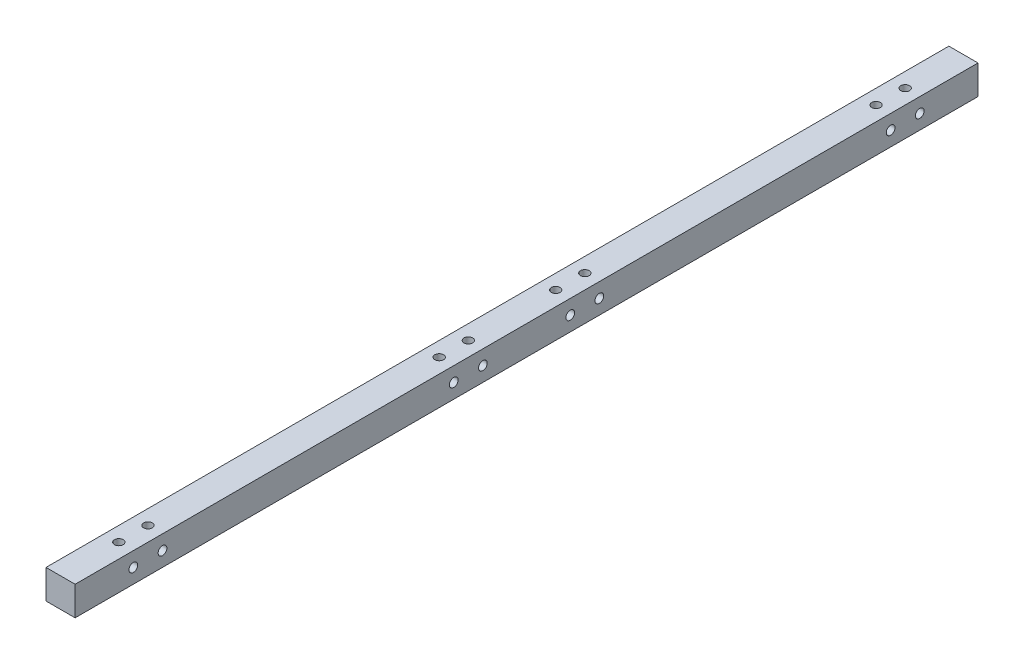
ISO-10303-21;
HEADER;
FILE_DESCRIPTION(('STEP AP214'),'2;1');
FILE_NAME('part.step','',(''),(''),'','','');
FILE_SCHEMA(('AUTOMOTIVE_DESIGN { 1 0 10303 214 1 1 1 1 }'));
ENDSEC;
DATA;
#1=APPLICATION_CONTEXT('core data for automotive mechanical design processes');
#2=APPLICATION_PROTOCOL_DEFINITION('international standard','automotive_design',2000,#1);
#3=PRODUCT_CONTEXT('',#1,'mechanical');
#4=PRODUCT('Part','Part','',(#3));
#5=PRODUCT_RELATED_PRODUCT_CATEGORY('part','',(#4));
#6=PRODUCT_DEFINITION_FORMATION('','',#4);
#7=PRODUCT_DEFINITION_CONTEXT('part definition',#1,'design');
#8=PRODUCT_DEFINITION('design','',#6,#7);
#9=PRODUCT_DEFINITION_SHAPE('','',#8);
#10=(LENGTH_UNIT() NAMED_UNIT(*) SI_UNIT(.MILLI.,.METRE.));
#11=(NAMED_UNIT(*) PLANE_ANGLE_UNIT() SI_UNIT($,.RADIAN.));
#12=(NAMED_UNIT(*) SI_UNIT($,.STERADIAN.) SOLID_ANGLE_UNIT());
#13=UNCERTAINTY_MEASURE_WITH_UNIT(LENGTH_MEASURE(1.E-05),#10,'distance_accuracy_value','');
#14=(GEOMETRIC_REPRESENTATION_CONTEXT(3) GLOBAL_UNCERTAINTY_ASSIGNED_CONTEXT((#13)) GLOBAL_UNIT_ASSIGNED_CONTEXT((#10,
#11,#12)) REPRESENTATION_CONTEXT('',''));
#15=CARTESIAN_POINT('',(0.,0.,0.));
#16=DIRECTION('',(0.,0.,1.));
#17=DIRECTION('',(1.,0.,0.));
#18=AXIS2_PLACEMENT_3D('',#15,#16,#17);
#19=CARTESIAN_POINT('',(0.,5.00000000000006,290.));
#20=DIRECTION('',(1.,0.,0.));
#21=DIRECTION('',(0.,0.,-1.));
#22=AXIS2_PLACEMENT_3D('',#19,#20,#21);
#23=CYLINDRICAL_SURFACE('',#22,1.50000000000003);
#24=CARTESIAN_POINT('',(10.,5.00000000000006,290.));
#25=DIRECTION('',(1.,0.,0.));
#26=DIRECTION('',(0.,0.,1.));
#27=AXIS2_PLACEMENT_3D('',#24,#25,#26);
#28=CIRCLE('',#27,1.50000000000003);
#29=CARTESIAN_POINT('',(10.,5.00000000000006,291.5));
#30=VERTEX_POINT('',#29);
#31=EDGE_CURVE('E253',#30,#30,#28,.T.);
#32=ORIENTED_EDGE('',*,*,#31,.T.);
#33=EDGE_LOOP('',(#32));
#34=FACE_BOUND('',#33,.T.);
#35=CARTESIAN_POINT('',(5.0000000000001,5.00000000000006,290.));
#36=DIRECTION('',(0.707106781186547,-0.707106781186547,0.));
#37=DIRECTION('',(0.707106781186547,0.707106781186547,0.));
#38=AXIS2_PLACEMENT_3D('',#35,#36,#37);
#39=ELLIPSE('',#38,2.12132034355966,1.50000000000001);
#40=CARTESIAN_POINT('',(5.0000000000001,5.00000000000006,291.5));
#41=VERTEX_POINT('',#40);
#42=CARTESIAN_POINT('',(5.0000000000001,5.00000000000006,288.5));
#43=VERTEX_POINT('',#42);
#44=EDGE_CURVE('E39',#41,#43,#39,.F.);
#45=ORIENTED_EDGE('',*,*,#44,.T.);
#46=CARTESIAN_POINT('',(5.0000000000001,5.00000000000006,290.));
#47=DIRECTION('',(0.707106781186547,0.707106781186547,0.));
#48=DIRECTION('',(0.707106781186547,-0.707106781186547,0.));
#49=AXIS2_PLACEMENT_3D('',#46,#47,#48);
#50=ELLIPSE('',#49,2.12132034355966,1.50000000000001);
#51=EDGE_CURVE('E11',#43,#41,#50,.F.);
#52=ORIENTED_EDGE('',*,*,#51,.T.);
#53=EDGE_LOOP('',(#45,#52));
#54=FACE_BOUND('',#53,.T.);
#55=ADVANCED_FACE('F26',(#34,#54),#23,.F.);
#56=CARTESIAN_POINT('',(0.,5.00000000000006,280.));
#57=DIRECTION('',(1.,0.,0.));
#58=DIRECTION('',(0.,0.,-1.));
#59=AXIS2_PLACEMENT_3D('',#56,#57,#58);
#60=CYLINDRICAL_SURFACE('',#59,1.50000000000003);
#61=CARTESIAN_POINT('',(10.,5.00000000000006,280.));
#62=DIRECTION('',(1.,0.,0.));
#63=DIRECTION('',(0.,0.,1.));
#64=AXIS2_PLACEMENT_3D('',#61,#62,#63);
#65=CIRCLE('',#64,1.50000000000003);
#66=CARTESIAN_POINT('',(10.,5.00000000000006,281.5));
#67=VERTEX_POINT('',#66);
#68=EDGE_CURVE('E247',#67,#67,#65,.T.);
#69=ORIENTED_EDGE('',*,*,#68,.T.);
#70=EDGE_LOOP('',(#69));
#71=FACE_BOUND('',#70,.T.);
#72=CARTESIAN_POINT('',(5.0000000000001,5.00000000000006,280.));
#73=DIRECTION('',(0.707106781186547,-0.707106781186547,0.));
#74=DIRECTION('',(0.707106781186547,0.707106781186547,0.));
#75=AXIS2_PLACEMENT_3D('',#72,#73,#74);
#76=ELLIPSE('',#75,2.12132034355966,1.50000000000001);
#77=CARTESIAN_POINT('',(5.0000000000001,5.00000000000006,281.5));
#78=VERTEX_POINT('',#77);
#79=CARTESIAN_POINT('',(5.0000000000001,5.00000000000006,278.5));
#80=VERTEX_POINT('',#79);
#81=EDGE_CURVE('E46',#78,#80,#76,.F.);
#82=ORIENTED_EDGE('',*,*,#81,.T.);
#83=CARTESIAN_POINT('',(5.0000000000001,5.00000000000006,280.));
#84=DIRECTION('',(0.707106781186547,0.707106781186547,0.));
#85=DIRECTION('',(0.707106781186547,-0.707106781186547,0.));
#86=AXIS2_PLACEMENT_3D('',#83,#84,#85);
#87=ELLIPSE('',#86,2.12132034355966,1.50000000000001);
#88=EDGE_CURVE('E123',#80,#78,#87,.F.);
#89=ORIENTED_EDGE('',*,*,#88,.T.);
#90=EDGE_LOOP('',(#82,#89));
#91=FACE_BOUND('',#90,.T.);
#92=ADVANCED_FACE('F378',(#71,#91),#60,.F.);
#93=CARTESIAN_POINT('',(0.,5.,180.));
#94=DIRECTION('',(1.,0.,0.));
#95=DIRECTION('',(0.,0.,-1.));
#96=AXIS2_PLACEMENT_3D('',#93,#94,#95);
#97=CYLINDRICAL_SURFACE('',#96,1.50000000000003);
#98=CARTESIAN_POINT('',(10.,5.,180.));
#99=DIRECTION('',(1.,0.,0.));
#100=DIRECTION('',(0.,0.,-1.));
#101=AXIS2_PLACEMENT_3D('',#98,#99,#100);
#102=CIRCLE('',#101,1.50000000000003);
#103=CARTESIAN_POINT('',(10.,5.,178.5));
#104=VERTEX_POINT('',#103);
#105=EDGE_CURVE('E241',#104,#104,#102,.T.);
#106=ORIENTED_EDGE('',*,*,#105,.T.);
#107=EDGE_LOOP('',(#106));
#108=FACE_BOUND('',#107,.T.);
#109=CARTESIAN_POINT('',(5.,5.,180.));
#110=DIRECTION('',(0.707106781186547,-0.707106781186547,0.));
#111=DIRECTION('',(0.707106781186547,0.707106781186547,0.));
#112=AXIS2_PLACEMENT_3D('',#109,#110,#111);
#113=ELLIPSE('',#112,2.12132034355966,1.50000000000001);
#114=CARTESIAN_POINT('',(5.,5.,181.5));
#115=VERTEX_POINT('',#114);
#116=CARTESIAN_POINT('',(5.,5.,178.5));
#117=VERTEX_POINT('',#116);
#118=EDGE_CURVE('E145',#115,#117,#113,.F.);
#119=ORIENTED_EDGE('',*,*,#118,.T.);
#120=CARTESIAN_POINT('',(5.,5.,180.));
#121=DIRECTION('',(0.707106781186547,0.707106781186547,0.));
#122=DIRECTION('',(0.707106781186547,-0.707106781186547,0.));
#123=AXIS2_PLACEMENT_3D('',#120,#121,#122);
#124=ELLIPSE('',#123,2.12132034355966,1.50000000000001);
#125=EDGE_CURVE('E136',#117,#115,#124,.F.);
#126=ORIENTED_EDGE('',*,*,#125,.T.);
#127=EDGE_LOOP('',(#119,#126));
#128=FACE_BOUND('',#127,.T.);
#129=ADVANCED_FACE('F384',(#108,#128),#97,.F.);
#130=CARTESIAN_POINT('',(0.,5.,170.));
#131=DIRECTION('',(1.,0.,0.));
#132=DIRECTION('',(0.,0.,-1.));
#133=AXIS2_PLACEMENT_3D('',#130,#131,#132);
#134=CYLINDRICAL_SURFACE('',#133,1.50000000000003);
#135=CARTESIAN_POINT('',(10.,5.,170.));
#136=DIRECTION('',(1.,0.,0.));
#137=DIRECTION('',(0.,0.,-1.));
#138=AXIS2_PLACEMENT_3D('',#135,#136,#137);
#139=CIRCLE('',#138,1.50000000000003);
#140=CARTESIAN_POINT('',(10.,5.,168.5));
#141=VERTEX_POINT('',#140);
#142=EDGE_CURVE('E235',#141,#141,#139,.T.);
#143=ORIENTED_EDGE('',*,*,#142,.T.);
#144=EDGE_LOOP('',(#143));
#145=FACE_BOUND('',#144,.T.);
#146=CARTESIAN_POINT('',(4.99999999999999,5.,170.));
#147=DIRECTION('',(0.707106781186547,-0.707106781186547,0.));
#148=DIRECTION('',(0.707106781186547,0.707106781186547,0.));
#149=AXIS2_PLACEMENT_3D('',#146,#147,#148);
#150=ELLIPSE('',#149,2.12132034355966,1.50000000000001);
#151=CARTESIAN_POINT('',(4.99999999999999,5.,171.5));
#152=VERTEX_POINT('',#151);
#153=CARTESIAN_POINT('',(4.99999999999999,5.,168.5));
#154=VERTEX_POINT('',#153);
#155=EDGE_CURVE('E156',#152,#154,#150,.F.);
#156=ORIENTED_EDGE('',*,*,#155,.T.);
#157=CARTESIAN_POINT('',(4.99999999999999,5.,170.));
#158=DIRECTION('',(0.707106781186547,0.707106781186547,0.));
#159=DIRECTION('',(0.707106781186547,-0.707106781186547,0.));
#160=AXIS2_PLACEMENT_3D('',#157,#158,#159);
#161=ELLIPSE('',#160,2.12132034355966,1.50000000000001);
#162=EDGE_CURVE('E147',#154,#152,#161,.F.);
#163=ORIENTED_EDGE('',*,*,#162,.T.);
#164=EDGE_LOOP('',(#156,#163));
#165=FACE_BOUND('',#164,.T.);
#166=ADVANCED_FACE('F411',(#145,#165),#134,.F.);
#167=CARTESIAN_POINT('',(0.,5.00000000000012,30.));
#168=DIRECTION('',(1.,0.,0.));
#169=DIRECTION('',(0.,0.,-1.));
#170=AXIS2_PLACEMENT_3D('',#167,#168,#169);
#171=CYLINDRICAL_SURFACE('',#170,1.5);
#172=CARTESIAN_POINT('',(10.,5.00000000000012,30.));
#173=DIRECTION('',(1.,0.,0.));
#174=DIRECTION('',(0.,0.,-1.));
#175=AXIS2_PLACEMENT_3D('',#172,#173,#174);
#176=CIRCLE('',#175,1.5);
#177=CARTESIAN_POINT('',(10.,5.00000000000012,28.5));
#178=VERTEX_POINT('',#177);
#179=EDGE_CURVE('E265',#178,#178,#176,.T.);
#180=ORIENTED_EDGE('',*,*,#179,.T.);
#181=EDGE_LOOP('',(#180));
#182=FACE_BOUND('',#181,.T.);
#183=CARTESIAN_POINT('',(5.,5.00000000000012,30.));
#184=DIRECTION('',(0.707106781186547,-0.707106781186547,0.));
#185=DIRECTION('',(0.707106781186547,0.707106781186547,0.));
#186=AXIS2_PLACEMENT_3D('',#183,#184,#185);
#187=ELLIPSE('',#186,2.12132034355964,1.5);
#188=CARTESIAN_POINT('',(5.,5.00000000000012,31.5));
#189=VERTEX_POINT('',#188);
#190=CARTESIAN_POINT('',(5.,5.00000000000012,28.5));
#191=VERTEX_POINT('',#190);
#192=EDGE_CURVE('E167',#189,#191,#187,.F.);
#193=ORIENTED_EDGE('',*,*,#192,.T.);
#194=CARTESIAN_POINT('',(5.,5.00000000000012,30.));
#195=DIRECTION('',(0.707106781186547,0.707106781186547,0.));
#196=DIRECTION('',(0.707106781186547,-0.707106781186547,0.));
#197=AXIS2_PLACEMENT_3D('',#194,#195,#196);
#198=ELLIPSE('',#197,2.12132034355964,1.5);
#199=EDGE_CURVE('E158',#191,#189,#198,.F.);
#200=ORIENTED_EDGE('',*,*,#199,.T.);
#201=EDGE_LOOP('',(#193,#200));
#202=FACE_BOUND('',#201,.T.);
#203=ADVANCED_FACE('F464',(#182,#202),#171,.F.);
#204=CARTESIAN_POINT('',(0.,5.00000000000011,20.));
#205=DIRECTION('',(1.,0.,0.));
#206=DIRECTION('',(0.,0.,-1.));
#207=AXIS2_PLACEMENT_3D('',#204,#205,#206);
#208=CYLINDRICAL_SURFACE('',#207,1.50000000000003);
#209=CARTESIAN_POINT('',(10.,5.00000000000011,20.));
#210=DIRECTION('',(1.,0.,0.));
#211=DIRECTION('',(0.,0.,-1.));
#212=AXIS2_PLACEMENT_3D('',#209,#210,#211);
#213=CIRCLE('',#212,1.50000000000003);
#214=CARTESIAN_POINT('',(10.,5.00000000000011,18.5));
#215=VERTEX_POINT('',#214);
#216=EDGE_CURVE('E259',#215,#215,#213,.T.);
#217=ORIENTED_EDGE('',*,*,#216,.T.);
#218=EDGE_LOOP('',(#217));
#219=FACE_BOUND('',#218,.T.);
#220=CARTESIAN_POINT('',(5.,5.00000000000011,20.));
#221=DIRECTION('',(0.707106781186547,-0.707106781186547,0.));
#222=DIRECTION('',(0.707106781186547,0.707106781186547,0.));
#223=AXIS2_PLACEMENT_3D('',#220,#221,#222);
#224=ELLIPSE('',#223,2.12132034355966,1.50000000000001);
#225=CARTESIAN_POINT('',(5.,5.00000000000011,21.5));
#226=VERTEX_POINT('',#225);
#227=CARTESIAN_POINT('',(5.,5.00000000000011,18.5));
#228=VERTEX_POINT('',#227);
#229=EDGE_CURVE('E178',#226,#228,#224,.F.);
#230=ORIENTED_EDGE('',*,*,#229,.T.);
#231=CARTESIAN_POINT('',(5.,5.00000000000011,20.));
#232=DIRECTION('',(0.707106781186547,0.707106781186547,0.));
#233=DIRECTION('',(0.707106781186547,-0.707106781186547,0.));
#234=AXIS2_PLACEMENT_3D('',#231,#232,#233);
#235=ELLIPSE('',#234,2.12132034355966,1.50000000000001);
#236=EDGE_CURVE('E169',#228,#226,#235,.F.);
#237=ORIENTED_EDGE('',*,*,#236,.T.);
#238=EDGE_LOOP('',(#230,#237));
#239=FACE_BOUND('',#238,.T.);
#240=ADVANCED_FACE('F397',(#219,#239),#208,.F.);
#241=CARTESIAN_POINT('',(0.,5.,130.));
#242=DIRECTION('',(1.,0.,0.));
#243=DIRECTION('',(0.,0.,-1.));
#244=AXIS2_PLACEMENT_3D('',#241,#242,#243);
#245=CYLINDRICAL_SURFACE('',#244,1.50000000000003);
#246=CARTESIAN_POINT('',(10.,5.,130.));
#247=DIRECTION('',(1.,0.,0.));
#248=DIRECTION('',(0.,0.,1.));
#249=AXIS2_PLACEMENT_3D('',#246,#247,#248);
#250=CIRCLE('',#249,1.50000000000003);
#251=CARTESIAN_POINT('',(10.,5.,131.5));
#252=VERTEX_POINT('',#251);
#253=EDGE_CURVE('E271',#252,#252,#250,.T.);
#254=ORIENTED_EDGE('',*,*,#253,.T.);
#255=EDGE_LOOP('',(#254));
#256=FACE_BOUND('',#255,.T.);
#257=CARTESIAN_POINT('',(5.,5.,130.));
#258=DIRECTION('',(0.707106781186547,-0.707106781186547,0.));
#259=DIRECTION('',(0.707106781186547,0.707106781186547,0.));
#260=AXIS2_PLACEMENT_3D('',#257,#258,#259);
#261=ELLIPSE('',#260,2.12132034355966,1.50000000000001);
#262=CARTESIAN_POINT('',(5.,5.,131.5));
#263=VERTEX_POINT('',#262);
#264=CARTESIAN_POINT('',(5.,5.,128.5));
#265=VERTEX_POINT('',#264);
#266=EDGE_CURVE('E189',#263,#265,#261,.F.);
#267=ORIENTED_EDGE('',*,*,#266,.T.);
#268=CARTESIAN_POINT('',(5.,5.,130.));
#269=DIRECTION('',(0.707106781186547,0.707106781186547,0.));
#270=DIRECTION('',(0.707106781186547,-0.707106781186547,0.));
#271=AXIS2_PLACEMENT_3D('',#268,#269,#270);
#272=ELLIPSE('',#271,2.12132034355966,1.50000000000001);
#273=EDGE_CURVE('E180',#265,#263,#272,.F.);
#274=ORIENTED_EDGE('',*,*,#273,.T.);
#275=EDGE_LOOP('',(#267,#274));
#276=FACE_BOUND('',#275,.T.);
#277=ADVANCED_FACE('F473',(#256,#276),#245,.F.);
#278=CARTESIAN_POINT('',(0.,5.,140.));
#279=DIRECTION('',(1.,0.,0.));
#280=DIRECTION('',(0.,0.,-1.));
#281=AXIS2_PLACEMENT_3D('',#278,#279,#280);
#282=CYLINDRICAL_SURFACE('',#281,1.50000000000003);
#283=CARTESIAN_POINT('',(10.,5.,140.));
#284=DIRECTION('',(1.,0.,0.));
#285=DIRECTION('',(0.,0.,1.));
#286=AXIS2_PLACEMENT_3D('',#283,#284,#285);
#287=CIRCLE('',#286,1.50000000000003);
#288=CARTESIAN_POINT('',(10.,5.,141.5));
#289=VERTEX_POINT('',#288);
#290=EDGE_CURVE('E277',#289,#289,#287,.T.);
#291=ORIENTED_EDGE('',*,*,#290,.T.);
#292=EDGE_LOOP('',(#291));
#293=FACE_BOUND('',#292,.T.);
#294=CARTESIAN_POINT('',(5.,5.,140.));
#295=DIRECTION('',(0.707106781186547,-0.707106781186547,0.));
#296=DIRECTION('',(0.707106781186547,0.707106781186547,0.));
#297=AXIS2_PLACEMENT_3D('',#294,#295,#296);
#298=ELLIPSE('',#297,2.12132034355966,1.50000000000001);
#299=CARTESIAN_POINT('',(5.,5.,141.5));
#300=VERTEX_POINT('',#299);
#301=CARTESIAN_POINT('',(5.,5.,138.5));
#302=VERTEX_POINT('',#301);
#303=EDGE_CURVE('E200',#300,#302,#298,.F.);
#304=ORIENTED_EDGE('',*,*,#303,.T.);
#305=CARTESIAN_POINT('',(5.,5.,140.));
#306=DIRECTION('',(0.707106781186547,0.707106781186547,0.));
#307=DIRECTION('',(0.707106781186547,-0.707106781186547,0.));
#308=AXIS2_PLACEMENT_3D('',#305,#306,#307);
#309=ELLIPSE('',#308,2.12132034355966,1.50000000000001);
#310=EDGE_CURVE('E191',#302,#300,#309,.F.);
#311=ORIENTED_EDGE('',*,*,#310,.T.);
#312=EDGE_LOOP('',(#304,#311));
#313=FACE_BOUND('',#312,.T.);
#314=ADVANCED_FACE('F427',(#293,#313),#282,.F.);
#315=CARTESIAN_POINT('',(0.,0.,310.));
#316=DIRECTION('',(1.,0.,0.));
#317=DIRECTION('',(0.,0.,-1.));
#318=AXIS2_PLACEMENT_3D('',#315,#316,#317);
#319=PLANE('',#318);
#320=CARTESIAN_POINT('',(0.,5.,140.));
#321=DIRECTION('',(1.,0.,0.));
#322=DIRECTION('',(0.,0.,1.));
#323=AXIS2_PLACEMENT_3D('',#320,#321,#322);
#324=CIRCLE('',#323,1.50000000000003);
#325=CARTESIAN_POINT('',(0.,5.,141.5));
#326=VERTEX_POINT('',#325);
#327=EDGE_CURVE('E274',#326,#326,#324,.T.);
#328=ORIENTED_EDGE('',*,*,#327,.T.);
#329=EDGE_LOOP('',(#328));
#330=FACE_BOUND('',#329,.T.);
#331=CARTESIAN_POINT('',(0.,5.,130.));
#332=DIRECTION('',(1.,0.,0.));
#333=DIRECTION('',(0.,0.,1.));
#334=AXIS2_PLACEMENT_3D('',#331,#332,#333);
#335=CIRCLE('',#334,1.50000000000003);
#336=CARTESIAN_POINT('',(0.,5.,131.5));
#337=VERTEX_POINT('',#336);
#338=EDGE_CURVE('E268',#337,#337,#335,.T.);
#339=ORIENTED_EDGE('',*,*,#338,.T.);
#340=EDGE_LOOP('',(#339));
#341=FACE_BOUND('',#340,.T.);
#342=CARTESIAN_POINT('',(0.,5.00000000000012,30.));
#343=DIRECTION('',(1.,0.,0.));
#344=DIRECTION('',(0.,0.,-1.));
#345=AXIS2_PLACEMENT_3D('',#342,#343,#344);
#346=CIRCLE('',#345,1.5);
#347=CARTESIAN_POINT('',(0.,5.00000000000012,28.5));
#348=VERTEX_POINT('',#347);
#349=EDGE_CURVE('E262',#348,#348,#346,.T.);
#350=ORIENTED_EDGE('',*,*,#349,.T.);
#351=EDGE_LOOP('',(#350));
#352=FACE_BOUND('',#351,.T.);
#353=CARTESIAN_POINT('',(0.,5.00000000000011,20.));
#354=DIRECTION('',(1.,0.,0.));
#355=DIRECTION('',(0.,0.,-1.));
#356=AXIS2_PLACEMENT_3D('',#353,#354,#355);
#357=CIRCLE('',#356,1.50000000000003);
#358=CARTESIAN_POINT('',(0.,5.00000000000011,18.5));
#359=VERTEX_POINT('',#358);
#360=EDGE_CURVE('E256',#359,#359,#357,.T.);
#361=ORIENTED_EDGE('',*,*,#360,.T.);
#362=EDGE_LOOP('',(#361));
#363=FACE_BOUND('',#362,.T.);
#364=CARTESIAN_POINT('',(0.,5.00000000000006,290.));
#365=DIRECTION('',(1.,0.,0.));
#366=DIRECTION('',(0.,0.,1.));
#367=AXIS2_PLACEMENT_3D('',#364,#365,#366);
#368=CIRCLE('',#367,1.50000000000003);
#369=CARTESIAN_POINT('',(0.,5.00000000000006,291.5));
#370=VERTEX_POINT('',#369);
#371=EDGE_CURVE('E250',#370,#370,#368,.T.);
#372=ORIENTED_EDGE('',*,*,#371,.T.);
#373=EDGE_LOOP('',(#372));
#374=FACE_BOUND('',#373,.T.);
#375=CARTESIAN_POINT('',(0.,5.00000000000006,280.));
#376=DIRECTION('',(1.,0.,0.));
#377=DIRECTION('',(0.,0.,1.));
#378=AXIS2_PLACEMENT_3D('',#375,#376,#377);
#379=CIRCLE('',#378,1.50000000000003);
#380=CARTESIAN_POINT('',(0.,5.00000000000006,281.5));
#381=VERTEX_POINT('',#380);
#382=EDGE_CURVE('E244',#381,#381,#379,.T.);
#383=ORIENTED_EDGE('',*,*,#382,.T.);
#384=EDGE_LOOP('',(#383));
#385=FACE_BOUND('',#384,.T.);
#386=CARTESIAN_POINT('',(0.,5.,180.));
#387=DIRECTION('',(1.,0.,0.));
#388=DIRECTION('',(0.,0.,-1.));
#389=AXIS2_PLACEMENT_3D('',#386,#387,#388);
#390=CIRCLE('',#389,1.50000000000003);
#391=CARTESIAN_POINT('',(0.,5.,178.5));
#392=VERTEX_POINT('',#391);
#393=EDGE_CURVE('E238',#392,#392,#390,.T.);
#394=ORIENTED_EDGE('',*,*,#393,.T.);
#395=EDGE_LOOP('',(#394));
#396=FACE_BOUND('',#395,.T.);
#397=CARTESIAN_POINT('',(0.,5.,170.));
#398=DIRECTION('',(1.,0.,0.));
#399=DIRECTION('',(0.,0.,-1.));
#400=AXIS2_PLACEMENT_3D('',#397,#398,#399);
#401=CIRCLE('',#400,1.50000000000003);
#402=CARTESIAN_POINT('',(0.,5.,168.5));
#403=VERTEX_POINT('',#402);
#404=EDGE_CURVE('E232',#403,#403,#401,.T.);
#405=ORIENTED_EDGE('',*,*,#404,.T.);
#406=EDGE_LOOP('',(#405));
#407=FACE_BOUND('',#406,.T.);
#408=DIRECTION('',(0.,-1.,0.));
#409=VECTOR('',#408,1.);
#410=CARTESIAN_POINT('',(0.,0.,0.));
#411=LINE('',#410,#409);
#412=CARTESIAN_POINT('',(0.,10.,0.));
#413=VERTEX_POINT('',#412);
#414=CARTESIAN_POINT('',(0.,0.,0.));
#415=VERTEX_POINT('',#414);
#416=EDGE_CURVE('E229',#413,#415,#411,.T.);
#417=ORIENTED_EDGE('',*,*,#416,.T.);
#418=DIRECTION('',(0.,0.,-1.));
#419=VECTOR('',#418,1.);
#420=CARTESIAN_POINT('',(0.,0.,310.));
#421=LINE('',#420,#419);
#422=CARTESIAN_POINT('',(0.,0.,310.));
#423=VERTEX_POINT('',#422);
#424=EDGE_CURVE('E202',#423,#415,#421,.T.);
#425=ORIENTED_EDGE('',*,*,#424,.F.);
#426=DIRECTION('',(0.,-1.,0.));
#427=VECTOR('',#426,1.);
#428=CARTESIAN_POINT('',(0.,0.,310.));
#429=LINE('',#428,#427);
#430=CARTESIAN_POINT('',(0.,10.,310.));
#431=VERTEX_POINT('',#430);
#432=EDGE_CURVE('E220',#431,#423,#429,.T.);
#433=ORIENTED_EDGE('',*,*,#432,.F.);
#434=DIRECTION('',(0.,0.,-1.));
#435=VECTOR('',#434,1.);
#436=CARTESIAN_POINT('',(0.,10.,310.));
#437=LINE('',#436,#435);
#438=EDGE_CURVE('E211',#431,#413,#437,.T.);
#439=ORIENTED_EDGE('',*,*,#438,.T.);
#440=EDGE_LOOP('',(#417,#425,#433,#439));
#441=FACE_BOUND('',#440,.T.);
#442=ADVANCED_FACE('F28',(#330,#341,#352,#363,#374,#385,#396,#407,#441),#319,.F.);
#443=CARTESIAN_POINT('',(0.,0.,310.));
#444=DIRECTION('',(0.,1.,0.));
#445=DIRECTION('',(0.,0.,1.));
#446=AXIS2_PLACEMENT_3D('',#443,#444,#445);
#447=PLANE('',#446);
#448=CARTESIAN_POINT('',(5.0000000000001,0.,290.));
#449=DIRECTION('',(0.,1.,0.));
#450=DIRECTION('',(0.,0.,1.));
#451=AXIS2_PLACEMENT_3D('',#448,#449,#450);
#452=CIRCLE('',#451,1.5);
#453=CARTESIAN_POINT('',(5.0000000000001,0.,291.5));
#454=VERTEX_POINT('',#453);
#455=EDGE_CURVE('E322',#454,#454,#452,.T.);
#456=ORIENTED_EDGE('',*,*,#455,.T.);
#457=EDGE_LOOP('',(#456));
#458=FACE_BOUND('',#457,.T.);
#459=CARTESIAN_POINT('',(5.0000000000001,0.,280.));
#460=DIRECTION('',(0.,1.,0.));
#461=DIRECTION('',(0.,0.,1.));
#462=AXIS2_PLACEMENT_3D('',#459,#460,#461);
#463=CIRCLE('',#462,1.5);
#464=CARTESIAN_POINT('',(5.0000000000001,0.,281.5));
#465=VERTEX_POINT('',#464);
#466=EDGE_CURVE('E316',#465,#465,#463,.T.);
#467=ORIENTED_EDGE('',*,*,#466,.T.);
#468=EDGE_LOOP('',(#467));
#469=FACE_BOUND('',#468,.T.);
#470=CARTESIAN_POINT('',(5.,0.,180.));
#471=DIRECTION('',(0.,1.,0.));
#472=DIRECTION('',(0.,0.,-1.));
#473=AXIS2_PLACEMENT_3D('',#470,#471,#472);
#474=CIRCLE('',#473,1.5);
#475=CARTESIAN_POINT('',(5.,0.,178.5));
#476=VERTEX_POINT('',#475);
#477=EDGE_CURVE('E310',#476,#476,#474,.T.);
#478=ORIENTED_EDGE('',*,*,#477,.T.);
#479=EDGE_LOOP('',(#478));
#480=FACE_BOUND('',#479,.T.);
#481=CARTESIAN_POINT('',(4.99999999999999,0.,170.));
#482=DIRECTION('',(0.,1.,0.));
#483=DIRECTION('',(0.,0.,-1.));
#484=AXIS2_PLACEMENT_3D('',#481,#482,#483);
#485=CIRCLE('',#484,1.5);
#486=CARTESIAN_POINT('',(4.99999999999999,0.,168.5));
#487=VERTEX_POINT('',#486);
#488=EDGE_CURVE('E304',#487,#487,#485,.T.);
#489=ORIENTED_EDGE('',*,*,#488,.T.);
#490=EDGE_LOOP('',(#489));
#491=FACE_BOUND('',#490,.T.);
#492=CARTESIAN_POINT('',(5.,0.,30.));
#493=DIRECTION('',(0.,1.,0.));
#494=DIRECTION('',(0.,0.,-1.));
#495=AXIS2_PLACEMENT_3D('',#492,#493,#494);
#496=CIRCLE('',#495,1.5);
#497=CARTESIAN_POINT('',(5.,0.,28.5));
#498=VERTEX_POINT('',#497);
#499=EDGE_CURVE('E298',#498,#498,#496,.T.);
#500=ORIENTED_EDGE('',*,*,#499,.T.);
#501=EDGE_LOOP('',(#500));
#502=FACE_BOUND('',#501,.T.);
#503=CARTESIAN_POINT('',(5.,0.,20.));
#504=DIRECTION('',(0.,1.,0.));
#505=DIRECTION('',(0.,0.,-1.));
#506=AXIS2_PLACEMENT_3D('',#503,#504,#505);
#507=CIRCLE('',#506,1.5);
#508=CARTESIAN_POINT('',(5.,0.,18.5));
#509=VERTEX_POINT('',#508);
#510=EDGE_CURVE('E292',#509,#509,#507,.T.);
#511=ORIENTED_EDGE('',*,*,#510,.T.);
#512=EDGE_LOOP('',(#511));
#513=FACE_BOUND('',#512,.T.);
#514=CARTESIAN_POINT('',(5.,0.,130.));
#515=DIRECTION('',(0.,1.,0.));
#516=DIRECTION('',(0.,0.,1.));
#517=AXIS2_PLACEMENT_3D('',#514,#515,#516);
#518=CIRCLE('',#517,1.5);
#519=CARTESIAN_POINT('',(5.,0.,131.5));
#520=VERTEX_POINT('',#519);
#521=EDGE_CURVE('E286',#520,#520,#518,.T.);
#522=ORIENTED_EDGE('',*,*,#521,.T.);
#523=EDGE_LOOP('',(#522));
#524=FACE_BOUND('',#523,.T.);
#525=CARTESIAN_POINT('',(5.,0.,140.));
#526=DIRECTION('',(0.,1.,0.));
#527=DIRECTION('',(0.,0.,1.));
#528=AXIS2_PLACEMENT_3D('',#525,#526,#527);
#529=CIRCLE('',#528,1.5);
#530=CARTESIAN_POINT('',(5.,0.,141.5));
#531=VERTEX_POINT('',#530);
#532=EDGE_CURVE('E280',#531,#531,#529,.T.);
#533=ORIENTED_EDGE('',*,*,#532,.T.);
#534=EDGE_LOOP('',(#533));
#535=FACE_BOUND('',#534,.T.);
#536=DIRECTION('',(1.,0.,0.));
#537=VECTOR('',#536,1.);
#538=CARTESIAN_POINT('',(0.,0.,0.));
#539=LINE('',#538,#537);
#540=CARTESIAN_POINT('',(10.,0.,0.));
#541=VERTEX_POINT('',#540);
#542=EDGE_CURVE('E227',#415,#541,#539,.T.);
#543=ORIENTED_EDGE('',*,*,#542,.T.);
#544=DIRECTION('',(0.,0.,-1.));
#545=VECTOR('',#544,1.);
#546=CARTESIAN_POINT('',(10.,0.,310.));
#547=LINE('',#546,#545);
#548=CARTESIAN_POINT('',(10.,0.,310.));
#549=VERTEX_POINT('',#548);
#550=EDGE_CURVE('E205',#549,#541,#547,.T.);
#551=ORIENTED_EDGE('',*,*,#550,.F.);
#552=DIRECTION('',(1.,0.,0.));
#553=VECTOR('',#552,1.);
#554=CARTESIAN_POINT('',(0.,0.,310.));
#555=LINE('',#554,#553);
#556=EDGE_CURVE('E218',#423,#549,#555,.T.);
#557=ORIENTED_EDGE('',*,*,#556,.F.);
#558=ORIENTED_EDGE('',*,*,#424,.T.);
#559=EDGE_LOOP('',(#543,#551,#557,#558));
#560=FACE_BOUND('',#559,.T.);
#561=ADVANCED_FACE('F363',(#458,#469,#480,#491,#502,#513,#524,#535,#560),#447,.F.);
#562=CARTESIAN_POINT('',(10.,0.,310.));
#563=DIRECTION('',(-1.,0.,0.));
#564=DIRECTION('',(0.,0.,1.));
#565=AXIS2_PLACEMENT_3D('',#562,#563,#564);
#566=PLANE('',#565);
#567=ORIENTED_EDGE('',*,*,#290,.F.);
#568=EDGE_LOOP('',(#567));
#569=FACE_BOUND('',#568,.T.);
#570=ORIENTED_EDGE('',*,*,#253,.F.);
#571=EDGE_LOOP('',(#570));
#572=FACE_BOUND('',#571,.T.);
#573=ORIENTED_EDGE('',*,*,#179,.F.);
#574=EDGE_LOOP('',(#573));
#575=FACE_BOUND('',#574,.T.);
#576=ORIENTED_EDGE('',*,*,#216,.F.);
#577=EDGE_LOOP('',(#576));
#578=FACE_BOUND('',#577,.T.);
#579=ORIENTED_EDGE('',*,*,#31,.F.);
#580=EDGE_LOOP('',(#579));
#581=FACE_BOUND('',#580,.T.);
#582=ORIENTED_EDGE('',*,*,#68,.F.);
#583=EDGE_LOOP('',(#582));
#584=FACE_BOUND('',#583,.T.);
#585=ORIENTED_EDGE('',*,*,#105,.F.);
#586=EDGE_LOOP('',(#585));
#587=FACE_BOUND('',#586,.T.);
#588=ORIENTED_EDGE('',*,*,#142,.F.);
#589=EDGE_LOOP('',(#588));
#590=FACE_BOUND('',#589,.T.);
#591=DIRECTION('',(0.,1.,0.));
#592=VECTOR('',#591,1.);
#593=CARTESIAN_POINT('',(10.,0.,0.));
#594=LINE('',#593,#592);
#595=CARTESIAN_POINT('',(10.,10.,0.));
#596=VERTEX_POINT('',#595);
#597=EDGE_CURVE('E225',#541,#596,#594,.T.);
#598=ORIENTED_EDGE('',*,*,#597,.T.);
#599=DIRECTION('',(0.,0.,-1.));
#600=VECTOR('',#599,1.);
#601=CARTESIAN_POINT('',(10.,10.,310.));
#602=LINE('',#601,#600);
#603=CARTESIAN_POINT('',(10.,10.,310.));
#604=VERTEX_POINT('',#603);
#605=EDGE_CURVE('E208',#604,#596,#602,.T.);
#606=ORIENTED_EDGE('',*,*,#605,.F.);
#607=DIRECTION('',(0.,1.,0.));
#608=VECTOR('',#607,1.);
#609=CARTESIAN_POINT('',(10.,0.,310.));
#610=LINE('',#609,#608);
#611=EDGE_CURVE('E216',#549,#604,#610,.T.);
#612=ORIENTED_EDGE('',*,*,#611,.F.);
#613=ORIENTED_EDGE('',*,*,#550,.T.);
#614=EDGE_LOOP('',(#598,#606,#612,#613));
#615=FACE_BOUND('',#614,.T.);
#616=ADVANCED_FACE('F334',(#569,#572,#575,#578,#581,#584,#587,#590,#615),#566,.F.);
#617=CARTESIAN_POINT('',(0.,10.,310.));
#618=DIRECTION('',(0.,-1.,0.));
#619=DIRECTION('',(0.,0.,-1.));
#620=AXIS2_PLACEMENT_3D('',#617,#618,#619);
#621=PLANE('',#620);
#622=CARTESIAN_POINT('',(5.0000000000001,10.,290.));
#623=DIRECTION('',(0.,1.,0.));
#624=DIRECTION('',(0.,0.,1.));
#625=AXIS2_PLACEMENT_3D('',#622,#623,#624);
#626=CIRCLE('',#625,1.5);
#627=CARTESIAN_POINT('',(5.0000000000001,10.,291.5));
#628=VERTEX_POINT('',#627);
#629=EDGE_CURVE('E325',#628,#628,#626,.T.);
#630=ORIENTED_EDGE('',*,*,#629,.F.);
#631=EDGE_LOOP('',(#630));
#632=FACE_BOUND('',#631,.T.);
#633=CARTESIAN_POINT('',(5.0000000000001,10.,280.));
#634=DIRECTION('',(0.,1.,0.));
#635=DIRECTION('',(0.,0.,1.));
#636=AXIS2_PLACEMENT_3D('',#633,#634,#635);
#637=CIRCLE('',#636,1.5);
#638=CARTESIAN_POINT('',(5.0000000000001,10.,281.5));
#639=VERTEX_POINT('',#638);
#640=EDGE_CURVE('E319',#639,#639,#637,.T.);
#641=ORIENTED_EDGE('',*,*,#640,.F.);
#642=EDGE_LOOP('',(#641));
#643=FACE_BOUND('',#642,.T.);
#644=CARTESIAN_POINT('',(5.,10.,180.));
#645=DIRECTION('',(0.,1.,0.));
#646=DIRECTION('',(0.,0.,-1.));
#647=AXIS2_PLACEMENT_3D('',#644,#645,#646);
#648=CIRCLE('',#647,1.5);
#649=CARTESIAN_POINT('',(5.,10.,178.5));
#650=VERTEX_POINT('',#649);
#651=EDGE_CURVE('E313',#650,#650,#648,.T.);
#652=ORIENTED_EDGE('',*,*,#651,.F.);
#653=EDGE_LOOP('',(#652));
#654=FACE_BOUND('',#653,.T.);
#655=CARTESIAN_POINT('',(4.99999999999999,10.,170.));
#656=DIRECTION('',(0.,1.,0.));
#657=DIRECTION('',(0.,0.,-1.));
#658=AXIS2_PLACEMENT_3D('',#655,#656,#657);
#659=CIRCLE('',#658,1.5);
#660=CARTESIAN_POINT('',(4.99999999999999,10.,168.5));
#661=VERTEX_POINT('',#660);
#662=EDGE_CURVE('E307',#661,#661,#659,.T.);
#663=ORIENTED_EDGE('',*,*,#662,.F.);
#664=EDGE_LOOP('',(#663));
#665=FACE_BOUND('',#664,.T.);
#666=CARTESIAN_POINT('',(5.,10.,30.));
#667=DIRECTION('',(0.,1.,0.));
#668=DIRECTION('',(0.,0.,-1.));
#669=AXIS2_PLACEMENT_3D('',#666,#667,#668);
#670=CIRCLE('',#669,1.5);
#671=CARTESIAN_POINT('',(5.,10.,28.5));
#672=VERTEX_POINT('',#671);
#673=EDGE_CURVE('E301',#672,#672,#670,.T.);
#674=ORIENTED_EDGE('',*,*,#673,.F.);
#675=EDGE_LOOP('',(#674));
#676=FACE_BOUND('',#675,.T.);
#677=CARTESIAN_POINT('',(5.,10.,20.));
#678=DIRECTION('',(0.,1.,0.));
#679=DIRECTION('',(0.,0.,-1.));
#680=AXIS2_PLACEMENT_3D('',#677,#678,#679);
#681=CIRCLE('',#680,1.5);
#682=CARTESIAN_POINT('',(5.,10.,18.5));
#683=VERTEX_POINT('',#682);
#684=EDGE_CURVE('E295',#683,#683,#681,.T.);
#685=ORIENTED_EDGE('',*,*,#684,.F.);
#686=EDGE_LOOP('',(#685));
#687=FACE_BOUND('',#686,.T.);
#688=CARTESIAN_POINT('',(5.,10.,130.));
#689=DIRECTION('',(0.,1.,0.));
#690=DIRECTION('',(0.,0.,1.));
#691=AXIS2_PLACEMENT_3D('',#688,#689,#690);
#692=CIRCLE('',#691,1.5);
#693=CARTESIAN_POINT('',(5.,10.,131.5));
#694=VERTEX_POINT('',#693);
#695=EDGE_CURVE('E289',#694,#694,#692,.T.);
#696=ORIENTED_EDGE('',*,*,#695,.F.);
#697=EDGE_LOOP('',(#696));
#698=FACE_BOUND('',#697,.T.);
#699=CARTESIAN_POINT('',(5.,10.,140.));
#700=DIRECTION('',(0.,1.,0.));
#701=DIRECTION('',(0.,0.,1.));
#702=AXIS2_PLACEMENT_3D('',#699,#700,#701);
#703=CIRCLE('',#702,1.5);
#704=CARTESIAN_POINT('',(5.,10.,141.5));
#705=VERTEX_POINT('',#704);
#706=EDGE_CURVE('E283',#705,#705,#703,.T.);
#707=ORIENTED_EDGE('',*,*,#706,.F.);
#708=EDGE_LOOP('',(#707));
#709=FACE_BOUND('',#708,.T.);
#710=DIRECTION('',(-1.,0.,0.));
#711=VECTOR('',#710,1.);
#712=CARTESIAN_POINT('',(0.,10.,0.));
#713=LINE('',#712,#711);
#714=EDGE_CURVE('E223',#596,#413,#713,.T.);
#715=ORIENTED_EDGE('',*,*,#714,.T.);
#716=ORIENTED_EDGE('',*,*,#438,.F.);
#717=DIRECTION('',(-1.,0.,0.));
#718=VECTOR('',#717,1.);
#719=CARTESIAN_POINT('',(0.,10.,310.));
#720=LINE('',#719,#718);
#721=EDGE_CURVE('E214',#604,#431,#720,.T.);
#722=ORIENTED_EDGE('',*,*,#721,.F.);
#723=ORIENTED_EDGE('',*,*,#605,.T.);
#724=EDGE_LOOP('',(#715,#716,#722,#723));
#725=FACE_BOUND('',#724,.T.);
#726=ADVANCED_FACE('F330',(#632,#643,#654,#665,#676,#687,#698,#709,#725),#621,.F.);
#727=CARTESIAN_POINT('',(0.,10.,310.));
#728=DIRECTION('',(0.,0.,-1.));
#729=DIRECTION('',(-1.,0.,0.));
#730=AXIS2_PLACEMENT_3D('',#727,#728,#729);
#731=PLANE('',#730);
#732=ORIENTED_EDGE('',*,*,#432,.T.);
#733=ORIENTED_EDGE('',*,*,#556,.T.);
#734=ORIENTED_EDGE('',*,*,#611,.T.);
#735=ORIENTED_EDGE('',*,*,#721,.T.);
#736=EDGE_LOOP('',(#732,#733,#734,#735));
#737=FACE_BOUND('',#736,.T.);
#738=ADVANCED_FACE('F333',(#737),#731,.F.);
#739=CARTESIAN_POINT('',(0.,10.,0.));
#740=DIRECTION('',(0.,0.,-1.));
#741=DIRECTION('',(-1.,0.,0.));
#742=AXIS2_PLACEMENT_3D('',#739,#740,#741);
#743=PLANE('',#742);
#744=ORIENTED_EDGE('',*,*,#416,.F.);
#745=ORIENTED_EDGE('',*,*,#714,.F.);
#746=ORIENTED_EDGE('',*,*,#597,.F.);
#747=ORIENTED_EDGE('',*,*,#542,.F.);
#748=EDGE_LOOP('',(#744,#745,#746,#747));
#749=FACE_BOUND('',#748,.T.);
#750=ADVANCED_FACE('F360',(#749),#743,.T.);
#751=CARTESIAN_POINT('',(4.99999999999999,5.,170.));
#752=DIRECTION('',(0.707106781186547,-0.707106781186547,0.));
#753=DIRECTION('',(0.707106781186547,0.707106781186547,0.));
#754=AXIS2_PLACEMENT_3D('',#751,#752,#753);
#755=ELLIPSE('',#754,2.12132034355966,1.50000000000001);
#756=EDGE_CURVE('E153',#152,#154,#755,.T.);
#757=ORIENTED_EDGE('',*,*,#756,.T.);
#758=CARTESIAN_POINT('',(4.99999999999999,5.,170.));
#759=DIRECTION('',(0.707106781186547,0.707106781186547,0.));
#760=DIRECTION('',(0.707106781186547,-0.707106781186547,0.));
#761=AXIS2_PLACEMENT_3D('',#758,#759,#760);
#762=ELLIPSE('',#761,2.12132034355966,1.50000000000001);
#763=EDGE_CURVE('E150',#154,#152,#762,.T.);
#764=ORIENTED_EDGE('',*,*,#763,.T.);
#765=EDGE_LOOP('',(#757,#764));
#766=FACE_BOUND('',#765,.T.);
#767=ORIENTED_EDGE('',*,*,#404,.F.);
#768=EDGE_LOOP('',(#767));
#769=FACE_BOUND('',#768,.T.);
#770=ADVANCED_FACE('F403',(#766,#769),#134,.F.);
#771=CARTESIAN_POINT('',(5.,5.,180.));
#772=DIRECTION('',(0.707106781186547,-0.707106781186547,0.));
#773=DIRECTION('',(0.707106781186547,0.707106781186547,0.));
#774=AXIS2_PLACEMENT_3D('',#771,#772,#773);
#775=ELLIPSE('',#774,2.12132034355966,1.50000000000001);
#776=EDGE_CURVE('E142',#115,#117,#775,.T.);
#777=ORIENTED_EDGE('',*,*,#776,.T.);
#778=CARTESIAN_POINT('',(5.,5.,180.));
#779=DIRECTION('',(0.707106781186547,0.707106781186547,0.));
#780=DIRECTION('',(0.707106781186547,-0.707106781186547,0.));
#781=AXIS2_PLACEMENT_3D('',#778,#779,#780);
#782=ELLIPSE('',#781,2.12132034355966,1.50000000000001);
#783=EDGE_CURVE('E139',#117,#115,#782,.T.);
#784=ORIENTED_EDGE('',*,*,#783,.T.);
#785=EDGE_LOOP('',(#777,#784));
#786=FACE_BOUND('',#785,.T.);
#787=ORIENTED_EDGE('',*,*,#393,.F.);
#788=EDGE_LOOP('',(#787));
#789=FACE_BOUND('',#788,.T.);
#790=ADVANCED_FACE('F398',(#786,#789),#97,.F.);
#791=CARTESIAN_POINT('',(5.0000000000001,5.00000000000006,280.));
#792=DIRECTION('',(0.707106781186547,-0.707106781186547,0.));
#793=DIRECTION('',(0.707106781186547,0.707106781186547,0.));
#794=AXIS2_PLACEMENT_3D('',#791,#792,#793);
#795=ELLIPSE('',#794,2.12132034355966,1.50000000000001);
#796=EDGE_CURVE('E132',#78,#80,#795,.T.);
#797=ORIENTED_EDGE('',*,*,#796,.T.);
#798=CARTESIAN_POINT('',(5.0000000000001,5.00000000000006,280.));
#799=DIRECTION('',(0.707106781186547,0.707106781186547,0.));
#800=DIRECTION('',(0.707106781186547,-0.707106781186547,0.));
#801=AXIS2_PLACEMENT_3D('',#798,#799,#800);
#802=ELLIPSE('',#801,2.12132034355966,1.50000000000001);
#803=EDGE_CURVE('E129',#80,#78,#802,.T.);
#804=ORIENTED_EDGE('',*,*,#803,.T.);
#805=EDGE_LOOP('',(#797,#804));
#806=FACE_BOUND('',#805,.T.);
#807=ORIENTED_EDGE('',*,*,#382,.F.);
#808=EDGE_LOOP('',(#807));
#809=FACE_BOUND('',#808,.T.);
#810=ADVANCED_FACE('F387',(#806,#809),#60,.F.);
#811=CARTESIAN_POINT('',(5.0000000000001,5.00000000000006,290.));
#812=DIRECTION('',(0.707106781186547,-0.707106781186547,0.));
#813=DIRECTION('',(0.707106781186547,0.707106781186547,0.));
#814=AXIS2_PLACEMENT_3D('',#811,#812,#813);
#815=ELLIPSE('',#814,2.12132034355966,1.50000000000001);
#816=EDGE_CURVE('E116',#41,#43,#815,.T.);
#817=ORIENTED_EDGE('',*,*,#816,.T.);
#818=CARTESIAN_POINT('',(5.0000000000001,5.00000000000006,290.));
#819=DIRECTION('',(0.707106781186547,0.707106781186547,0.));
#820=DIRECTION('',(0.707106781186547,-0.707106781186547,0.));
#821=AXIS2_PLACEMENT_3D('',#818,#819,#820);
#822=ELLIPSE('',#821,2.12132034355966,1.50000000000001);
#823=EDGE_CURVE('E34',#43,#41,#822,.T.);
#824=ORIENTED_EDGE('',*,*,#823,.T.);
#825=EDGE_LOOP('',(#817,#824));
#826=FACE_BOUND('',#825,.T.);
#827=ORIENTED_EDGE('',*,*,#371,.F.);
#828=EDGE_LOOP('',(#827));
#829=FACE_BOUND('',#828,.T.);
#830=ADVANCED_FACE('F125',(#826,#829),#23,.F.);
#831=CARTESIAN_POINT('',(5.,5.00000000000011,20.));
#832=DIRECTION('',(0.707106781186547,-0.707106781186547,0.));
#833=DIRECTION('',(0.707106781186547,0.707106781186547,0.));
#834=AXIS2_PLACEMENT_3D('',#831,#832,#833);
#835=ELLIPSE('',#834,2.12132034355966,1.50000000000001);
#836=EDGE_CURVE('E175',#226,#228,#835,.T.);
#837=ORIENTED_EDGE('',*,*,#836,.T.);
#838=CARTESIAN_POINT('',(5.,5.00000000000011,20.));
#839=DIRECTION('',(0.707106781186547,0.707106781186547,0.));
#840=DIRECTION('',(0.707106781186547,-0.707106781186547,0.));
#841=AXIS2_PLACEMENT_3D('',#838,#839,#840);
#842=ELLIPSE('',#841,2.12132034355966,1.50000000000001);
#843=EDGE_CURVE('E172',#228,#226,#842,.T.);
#844=ORIENTED_EDGE('',*,*,#843,.T.);
#845=EDGE_LOOP('',(#837,#844));
#846=FACE_BOUND('',#845,.T.);
#847=ORIENTED_EDGE('',*,*,#360,.F.);
#848=EDGE_LOOP('',(#847));
#849=FACE_BOUND('',#848,.T.);
#850=ADVANCED_FACE('F390',(#846,#849),#208,.F.);
#851=CARTESIAN_POINT('',(5.,5.00000000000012,30.));
#852=DIRECTION('',(0.707106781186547,-0.707106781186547,0.));
#853=DIRECTION('',(0.707106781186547,0.707106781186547,0.));
#854=AXIS2_PLACEMENT_3D('',#851,#852,#853);
#855=ELLIPSE('',#854,2.12132034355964,1.5);
#856=EDGE_CURVE('E164',#189,#191,#855,.T.);
#857=ORIENTED_EDGE('',*,*,#856,.T.);
#858=CARTESIAN_POINT('',(5.,5.00000000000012,30.));
#859=DIRECTION('',(0.707106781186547,0.707106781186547,0.));
#860=DIRECTION('',(0.707106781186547,-0.707106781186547,0.));
#861=AXIS2_PLACEMENT_3D('',#858,#859,#860);
#862=ELLIPSE('',#861,2.12132034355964,1.5);
#863=EDGE_CURVE('E161',#191,#189,#862,.T.);
#864=ORIENTED_EDGE('',*,*,#863,.T.);
#865=EDGE_LOOP('',(#857,#864));
#866=FACE_BOUND('',#865,.T.);
#867=ORIENTED_EDGE('',*,*,#349,.F.);
#868=EDGE_LOOP('',(#867));
#869=FACE_BOUND('',#868,.T.);
#870=ADVANCED_FACE('F395',(#866,#869),#171,.F.);
#871=CARTESIAN_POINT('',(5.,5.,130.));
#872=DIRECTION('',(0.707106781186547,-0.707106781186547,0.));
#873=DIRECTION('',(0.707106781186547,0.707106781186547,0.));
#874=AXIS2_PLACEMENT_3D('',#871,#872,#873);
#875=ELLIPSE('',#874,2.12132034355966,1.50000000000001);
#876=EDGE_CURVE('E186',#263,#265,#875,.T.);
#877=ORIENTED_EDGE('',*,*,#876,.T.);
#878=CARTESIAN_POINT('',(5.,5.,130.));
#879=DIRECTION('',(0.707106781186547,0.707106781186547,0.));
#880=DIRECTION('',(0.707106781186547,-0.707106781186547,0.));
#881=AXIS2_PLACEMENT_3D('',#878,#879,#880);
#882=ELLIPSE('',#881,2.12132034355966,1.50000000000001);
#883=EDGE_CURVE('E183',#265,#263,#882,.T.);
#884=ORIENTED_EDGE('',*,*,#883,.T.);
#885=EDGE_LOOP('',(#877,#884));
#886=FACE_BOUND('',#885,.T.);
#887=ORIENTED_EDGE('',*,*,#338,.F.);
#888=EDGE_LOOP('',(#887));
#889=FACE_BOUND('',#888,.T.);
#890=ADVANCED_FACE('F461',(#886,#889),#245,.F.);
#891=CARTESIAN_POINT('',(5.,5.,140.));
#892=DIRECTION('',(0.707106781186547,-0.707106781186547,0.));
#893=DIRECTION('',(0.707106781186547,0.707106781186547,0.));
#894=AXIS2_PLACEMENT_3D('',#891,#892,#893);
#895=ELLIPSE('',#894,2.12132034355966,1.50000000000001);
#896=EDGE_CURVE('E197',#300,#302,#895,.T.);
#897=ORIENTED_EDGE('',*,*,#896,.T.);
#898=CARTESIAN_POINT('',(5.,5.,140.));
#899=DIRECTION('',(0.707106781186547,0.707106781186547,0.));
#900=DIRECTION('',(0.707106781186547,-0.707106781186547,0.));
#901=AXIS2_PLACEMENT_3D('',#898,#899,#900);
#902=ELLIPSE('',#901,2.12132034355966,1.50000000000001);
#903=EDGE_CURVE('E194',#302,#300,#902,.T.);
#904=ORIENTED_EDGE('',*,*,#903,.T.);
#905=EDGE_LOOP('',(#897,#904));
#906=FACE_BOUND('',#905,.T.);
#907=ORIENTED_EDGE('',*,*,#327,.F.);
#908=EDGE_LOOP('',(#907));
#909=FACE_BOUND('',#908,.T.);
#910=ADVANCED_FACE('F470',(#906,#909),#282,.F.);
#911=CARTESIAN_POINT('',(5.,0.,140.));
#912=DIRECTION('',(0.,1.,0.));
#913=DIRECTION('',(0.,0.,1.));
#914=AXIS2_PLACEMENT_3D('',#911,#912,#913);
#915=CYLINDRICAL_SURFACE('',#914,1.5);
#916=ORIENTED_EDGE('',*,*,#706,.T.);
#917=EDGE_LOOP('',(#916));
#918=FACE_BOUND('',#917,.T.);
#919=ORIENTED_EDGE('',*,*,#303,.F.);
#920=ORIENTED_EDGE('',*,*,#903,.F.);
#921=EDGE_LOOP('',(#919,#920));
#922=FACE_BOUND('',#921,.T.);
#923=ADVANCED_FACE('F479',(#918,#922),#915,.F.);
#924=ORIENTED_EDGE('',*,*,#532,.F.);
#925=EDGE_LOOP('',(#924));
#926=FACE_BOUND('',#925,.T.);
#927=ORIENTED_EDGE('',*,*,#896,.F.);
#928=ORIENTED_EDGE('',*,*,#310,.F.);
#929=EDGE_LOOP('',(#927,#928));
#930=FACE_BOUND('',#929,.T.);
#931=ADVANCED_FACE('F528',(#926,#930),#915,.F.);
#932=CARTESIAN_POINT('',(5.,0.,130.));
#933=DIRECTION('',(0.,1.,0.));
#934=DIRECTION('',(0.,0.,1.));
#935=AXIS2_PLACEMENT_3D('',#932,#933,#934);
#936=CYLINDRICAL_SURFACE('',#935,1.5);
#937=ORIENTED_EDGE('',*,*,#695,.T.);
#938=EDGE_LOOP('',(#937));
#939=FACE_BOUND('',#938,.T.);
#940=ORIENTED_EDGE('',*,*,#266,.F.);
#941=ORIENTED_EDGE('',*,*,#883,.F.);
#942=EDGE_LOOP('',(#940,#941));
#943=FACE_BOUND('',#942,.T.);
#944=ADVANCED_FACE('F536',(#939,#943),#936,.F.);
#945=ORIENTED_EDGE('',*,*,#521,.F.);
#946=EDGE_LOOP('',(#945));
#947=FACE_BOUND('',#946,.T.);
#948=ORIENTED_EDGE('',*,*,#876,.F.);
#949=ORIENTED_EDGE('',*,*,#273,.F.);
#950=EDGE_LOOP('',(#948,#949));
#951=FACE_BOUND('',#950,.T.);
#952=ADVANCED_FACE('F543',(#947,#951),#936,.F.);
#953=CARTESIAN_POINT('',(5.,0.,20.));
#954=DIRECTION('',(0.,1.,0.));
#955=DIRECTION('',(0.,0.,1.));
#956=AXIS2_PLACEMENT_3D('',#953,#954,#955);
#957=CYLINDRICAL_SURFACE('',#956,1.5);
#958=ORIENTED_EDGE('',*,*,#684,.T.);
#959=EDGE_LOOP('',(#958));
#960=FACE_BOUND('',#959,.T.);
#961=ORIENTED_EDGE('',*,*,#229,.F.);
#962=ORIENTED_EDGE('',*,*,#843,.F.);
#963=EDGE_LOOP('',(#961,#962));
#964=FACE_BOUND('',#963,.T.);
#965=ADVANCED_FACE('F551',(#960,#964),#957,.F.);
#966=ORIENTED_EDGE('',*,*,#510,.F.);
#967=EDGE_LOOP('',(#966));
#968=FACE_BOUND('',#967,.T.);
#969=ORIENTED_EDGE('',*,*,#836,.F.);
#970=ORIENTED_EDGE('',*,*,#236,.F.);
#971=EDGE_LOOP('',(#969,#970));
#972=FACE_BOUND('',#971,.T.);
#973=ADVANCED_FACE('F558',(#968,#972),#957,.F.);
#974=CARTESIAN_POINT('',(5.,0.,30.));
#975=DIRECTION('',(0.,1.,0.));
#976=DIRECTION('',(0.,0.,1.));
#977=AXIS2_PLACEMENT_3D('',#974,#975,#976);
#978=CYLINDRICAL_SURFACE('',#977,1.5);
#979=ORIENTED_EDGE('',*,*,#673,.T.);
#980=EDGE_LOOP('',(#979));
#981=FACE_BOUND('',#980,.T.);
#982=ORIENTED_EDGE('',*,*,#192,.F.);
#983=ORIENTED_EDGE('',*,*,#863,.F.);
#984=EDGE_LOOP('',(#982,#983));
#985=FACE_BOUND('',#984,.T.);
#986=ADVANCED_FACE('F566',(#981,#985),#978,.F.);
#987=ORIENTED_EDGE('',*,*,#499,.F.);
#988=EDGE_LOOP('',(#987));
#989=FACE_BOUND('',#988,.T.);
#990=ORIENTED_EDGE('',*,*,#856,.F.);
#991=ORIENTED_EDGE('',*,*,#199,.F.);
#992=EDGE_LOOP('',(#990,#991));
#993=FACE_BOUND('',#992,.T.);
#994=ADVANCED_FACE('F573',(#989,#993),#978,.F.);
#995=CARTESIAN_POINT('',(4.99999999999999,0.,170.));
#996=DIRECTION('',(0.,1.,0.));
#997=DIRECTION('',(0.,0.,1.));
#998=AXIS2_PLACEMENT_3D('',#995,#996,#997);
#999=CYLINDRICAL_SURFACE('',#998,1.5);
#1000=ORIENTED_EDGE('',*,*,#662,.T.);
#1001=EDGE_LOOP('',(#1000));
#1002=FACE_BOUND('',#1001,.T.);
#1003=ORIENTED_EDGE('',*,*,#155,.F.);
#1004=ORIENTED_EDGE('',*,*,#763,.F.);
#1005=EDGE_LOOP('',(#1003,#1004));
#1006=FACE_BOUND('',#1005,.T.);
#1007=ADVANCED_FACE('F581',(#1002,#1006),#999,.F.);
#1008=ORIENTED_EDGE('',*,*,#488,.F.);
#1009=EDGE_LOOP('',(#1008));
#1010=FACE_BOUND('',#1009,.T.);
#1011=ORIENTED_EDGE('',*,*,#756,.F.);
#1012=ORIENTED_EDGE('',*,*,#162,.F.);
#1013=EDGE_LOOP('',(#1011,#1012));
#1014=FACE_BOUND('',#1013,.T.);
#1015=ADVANCED_FACE('F588',(#1010,#1014),#999,.F.);
#1016=CARTESIAN_POINT('',(5.,0.,180.));
#1017=DIRECTION('',(0.,1.,0.));
#1018=DIRECTION('',(0.,0.,1.));
#1019=AXIS2_PLACEMENT_3D('',#1016,#1017,#1018);
#1020=CYLINDRICAL_SURFACE('',#1019,1.5);
#1021=ORIENTED_EDGE('',*,*,#651,.T.);
#1022=EDGE_LOOP('',(#1021));
#1023=FACE_BOUND('',#1022,.T.);
#1024=ORIENTED_EDGE('',*,*,#118,.F.);
#1025=ORIENTED_EDGE('',*,*,#783,.F.);
#1026=EDGE_LOOP('',(#1024,#1025));
#1027=FACE_BOUND('',#1026,.T.);
#1028=ADVANCED_FACE('F596',(#1023,#1027),#1020,.F.);
#1029=ORIENTED_EDGE('',*,*,#477,.F.);
#1030=EDGE_LOOP('',(#1029));
#1031=FACE_BOUND('',#1030,.T.);
#1032=ORIENTED_EDGE('',*,*,#776,.F.);
#1033=ORIENTED_EDGE('',*,*,#125,.F.);
#1034=EDGE_LOOP('',(#1032,#1033));
#1035=FACE_BOUND('',#1034,.T.);
#1036=ADVANCED_FACE('F603',(#1031,#1035),#1020,.F.);
#1037=CARTESIAN_POINT('',(5.0000000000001,0.,280.));
#1038=DIRECTION('',(0.,1.,0.));
#1039=DIRECTION('',(0.,0.,1.));
#1040=AXIS2_PLACEMENT_3D('',#1037,#1038,#1039);
#1041=CYLINDRICAL_SURFACE('',#1040,1.5);
#1042=ORIENTED_EDGE('',*,*,#640,.T.);
#1043=EDGE_LOOP('',(#1042));
#1044=FACE_BOUND('',#1043,.T.);
#1045=ORIENTED_EDGE('',*,*,#81,.F.);
#1046=ORIENTED_EDGE('',*,*,#803,.F.);
#1047=EDGE_LOOP('',(#1045,#1046));
#1048=FACE_BOUND('',#1047,.T.);
#1049=ADVANCED_FACE('F611',(#1044,#1048),#1041,.F.);
#1050=ORIENTED_EDGE('',*,*,#466,.F.);
#1051=EDGE_LOOP('',(#1050));
#1052=FACE_BOUND('',#1051,.T.);
#1053=ORIENTED_EDGE('',*,*,#796,.F.);
#1054=ORIENTED_EDGE('',*,*,#88,.F.);
#1055=EDGE_LOOP('',(#1053,#1054));
#1056=FACE_BOUND('',#1055,.T.);
#1057=ADVANCED_FACE('F618',(#1052,#1056),#1041,.F.);
#1058=CARTESIAN_POINT('',(5.0000000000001,0.,290.));
#1059=DIRECTION('',(0.,1.,0.));
#1060=DIRECTION('',(0.,0.,1.));
#1061=AXIS2_PLACEMENT_3D('',#1058,#1059,#1060);
#1062=CYLINDRICAL_SURFACE('',#1061,1.5);
#1063=ORIENTED_EDGE('',*,*,#629,.T.);
#1064=EDGE_LOOP('',(#1063));
#1065=FACE_BOUND('',#1064,.T.);
#1066=ORIENTED_EDGE('',*,*,#44,.F.);
#1067=ORIENTED_EDGE('',*,*,#823,.F.);
#1068=EDGE_LOOP('',(#1066,#1067));
#1069=FACE_BOUND('',#1068,.T.);
#1070=ADVANCED_FACE('F122',(#1065,#1069),#1062,.F.);
#1071=ORIENTED_EDGE('',*,*,#455,.F.);
#1072=EDGE_LOOP('',(#1071));
#1073=FACE_BOUND('',#1072,.T.);
#1074=ORIENTED_EDGE('',*,*,#816,.F.);
#1075=ORIENTED_EDGE('',*,*,#51,.F.);
#1076=EDGE_LOOP('',(#1074,#1075));
#1077=FACE_BOUND('',#1076,.T.);
#1078=ADVANCED_FACE('F117',(#1073,#1077),#1062,.F.);
#1079=CLOSED_SHELL('',(#55,#92,#129,#166,#203,#240,#277,#314,#442,#561,#616,#726,#738,#750,#770,
#790,#810,#830,#850,#870,#890,#910,#923,#931,#944,#952,#965,#973,#986,#994,#1007,#1015,#1028,
#1036,#1049,#1057,#1070,#1078));
#1080=MANIFOLD_SOLID_BREP('B2',#1079);
#1081=ADVANCED_BREP_SHAPE_REPRESENTATION('',(#18,#1080),#14);
#1082=SHAPE_DEFINITION_REPRESENTATION(#9,#1081);
ENDSEC;
END-ISO-10303-21;
